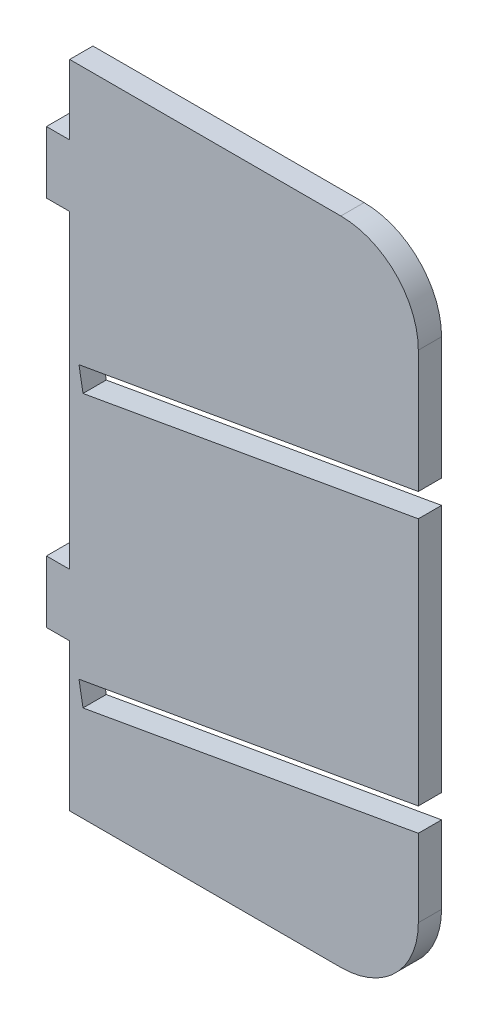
from build123d import *

# Parameters (mm, degrees)
SALIENTE_EXTRUIR1_DEPTH = 15
REDONDEO1_R             = 50
REDONDEO2_R             = 50
CORTAR_EXTRUIR2_REACH   = 263.199


with BuildPart() as part:
    # Croquis1 → Saliente-Extruir1 (new body)
    with BuildSketch(Plane.XY):
        Polygon((-125, 175), (-140, 175), (-140, 135), (-125, 135), (-125, -65), (-140, -65), (-140, -105), (-125, -105), (-125, -200), (100, -200), (100, 220), (-125, 220), align=None)
    extrude(amount=SALIENTE_EXTRUIR1_DEPTH)

    # Redondeo1
    redondeo1_edges = [part.edges().sort_by_distance(p)[0] for p in [
        (100, -200, 7.5),
    ]]
    fillet(redondeo1_edges, radius=REDONDEO1_R)

    # Redondeo2
    redondeo2_edges = [part.edges().sort_by_distance(p)[0] for p in [
        (100, 220, 7.5),
    ]]
    fillet(redondeo2_edges, radius=REDONDEO2_R)

    # Croquis4 → Cortar-Extruir2 (cut, up to next)
    with BuildSketch(Plane.XY.offset(15), mode=Mode.PRIVATE) as cortar_extruir2_sk1:
        Polygon((100, 91), (-119, 52.384391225), (-116.395277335, 37.61227493), (100, 75.768600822), align=None)
    cortar_extruir2_tool1 = extrude(cortar_extruir2_sk1.sketch, amount=-CORTAR_EXTRUIR2_REACH, mode=Mode.PRIVATE) & part.part
    # Croquis4 → Cortar-Extruir2 (cut, up to next)
    with BuildSketch(Plane.XY.offset(15), mode=Mode.PRIVATE) as cortar_extruir2_sk2:
        Polygon((-119, -123.384209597), (-116.395277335, -138.156325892), (100, -100), (100, -84.768600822), align=None)
    cortar_extruir2_tool2 = extrude(cortar_extruir2_sk2.sketch, amount=-CORTAR_EXTRUIR2_REACH, mode=Mode.PRIVATE) & part.part
    add(cortar_extruir2_tool1.solids().sort_by_distance((-8.850118, 64.206275, 15))[0], mode=Mode.SUBTRACT)
    add(cortar_extruir2_tool2.solids().sort_by_distance((-8.850118, -111.562326, 15))[0], mode=Mode.SUBTRACT)


solid = part.part
